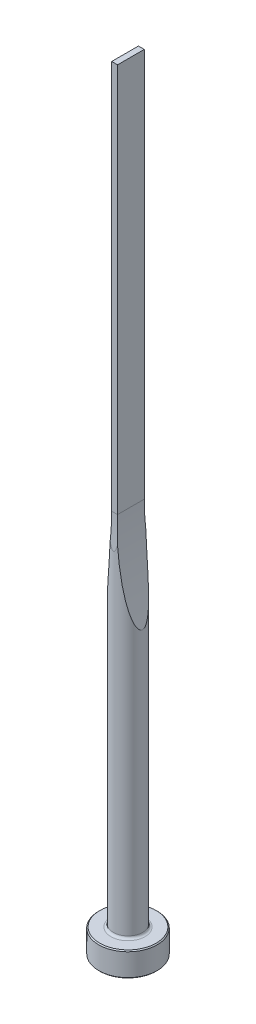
from build123d import *

# Parameters (mm, degrees)
CUT_EXTRUDE1_DEPTH = 5
CUT_EXTRUDE2_DEPTH = 5


with BuildPart() as part:
    # Sketch1 → Revolve1 (revolve)
    with BuildSketch(Plane.XY, mode=Mode.PRIVATE) as revolve1_sk:
        with BuildLine():
            Line((0, 0), (5.8, 0))
            Line((5.8, 0), (6, 0.2))
            Line((6, 0.2), (6, 4.8))
            Line((6, 4.8), (5.8, 5))
            Line((5.8, 5), (3.5, 5))
            ThreePointArc((3.5, 5), (3.146446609, 5.146446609), (3, 5.5))
            Line((3, 5.5), (3, 160))
            Line((3, 160), (0, 160))
            Line((0, 160), (0, 0))
        make_face()
    revolve(revolve1_sk.sketch.rotate(Axis((0, 160, 0), (0, -1, 0)), 180), axis=Axis((0, 160, 0), (0, -1, 0)))

    # Sketch2 → Cut-Extrude1 (cut, symmetric)
    with BuildSketch(Plane.XY):
        with BuildLine():
            Line((0.6, 160), (0.6, 80))
            ThreePointArc((0.6, 80), (1.202013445, 69.607695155), (3, 59.354419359))
            Line((3, 59.354419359), (3, 160))
            Line((3, 160), (0.6, 160))
        make_face()
        with BuildLine():
            Line((-0.6, 160), (-0.6, 80))
            ThreePointArc((-0.6, 80), (-1.202013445, 69.607695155), (-3, 59.354419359))
            Line((-3, 59.354419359), (-3, 160))
            Line((-3, 160), (-0.6, 160))
        make_face()
    extrude(amount=CUT_EXTRUDE1_DEPTH, both=True, mode=Mode.SUBTRACT)

    # Sketch3 → Cut-Extrude2 (cut, symmetric)
    with BuildSketch(Plane(origin=(0, 0, 0), x_dir=(0, 0, -1), z_dir=(1, 0, 0))):
        with BuildLine():
            Line((2.75, 160), (2.75, 80))
            ThreePointArc((2.75, 80), (2.812521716, 76.645898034), (3, 73.296456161))
            Line((3, 73.296456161), (3, 160))
            Line((3, 160), (2.75, 160))
        make_face()
        with BuildLine():
            Line((-2.75, 160), (-2.75, 80))
            ThreePointArc((-2.75, 80), (-2.812521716, 76.645898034), (-3, 73.296456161))
            Line((-3, 73.296456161), (-3, 160))
            Line((-3, 160), (-2.75, 160))
        make_face()
    extrude(amount=CUT_EXTRUDE2_DEPTH, both=True, mode=Mode.SUBTRACT)


solid = part.part
